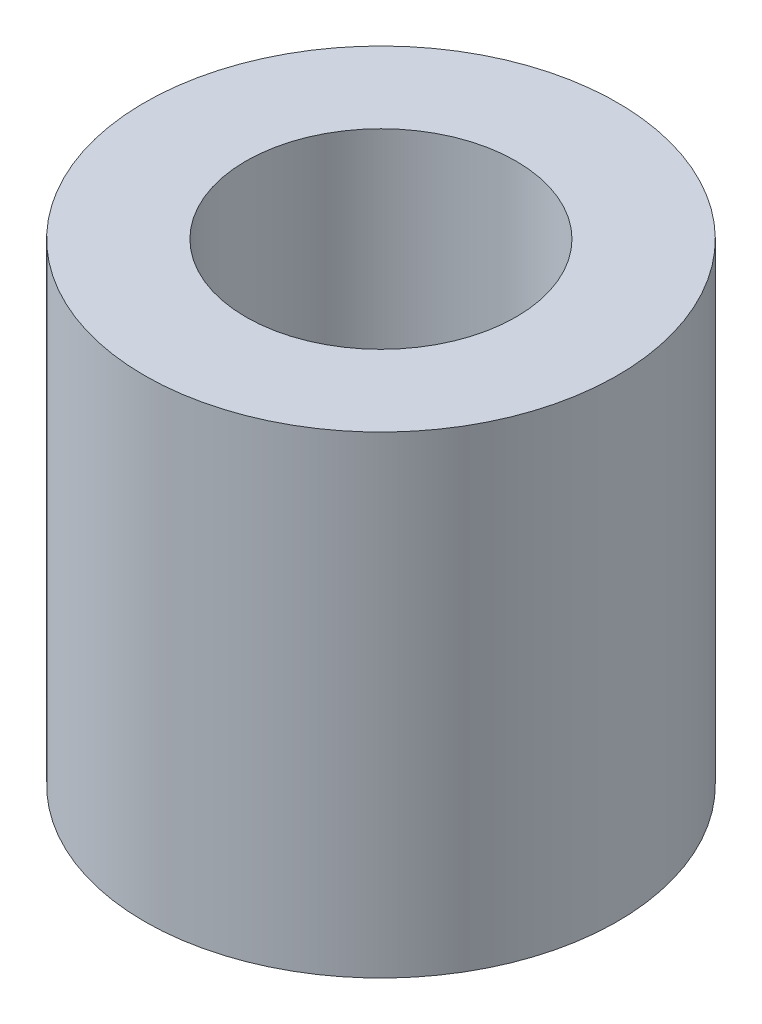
from build123d import *

# Parameters (mm, degrees)
SKETCH1_R           = 175
SKETCH1_R_2         = 100
BOSS_EXTRUDE1_DEPTH = 350


with BuildPart() as part:
    # Sketch1 → Boss-Extrude1 (new body)
    with BuildSketch(Plane(origin=(0, 0, 0), x_dir=(1, 0, 0), z_dir=(0, 1, 0))):
        with Locations(Location((0, 0, 0), (0, 0, 270))):
            Circle(SKETCH1_R)
        with Locations(Location((0, 0, 0), (0, 0, 270))):
            Circle(SKETCH1_R_2, mode=Mode.SUBTRACT)
    extrude(amount=BOSS_EXTRUDE1_DEPTH)


solid = part.part
